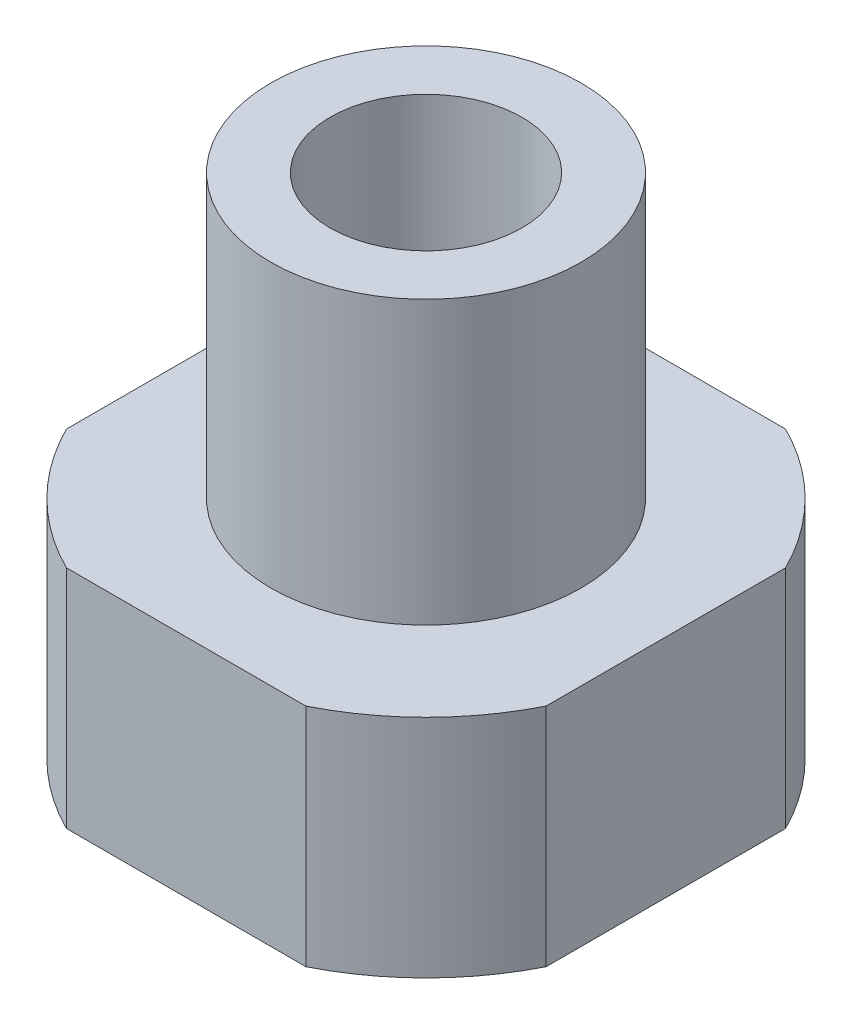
ISO-10303-21;
HEADER;
FILE_DESCRIPTION(('STEP AP214'),'2;1');
FILE_NAME('part.step','',(''),(''),'','','');
FILE_SCHEMA(('AUTOMOTIVE_DESIGN { 1 0 10303 214 1 1 1 1 }'));
ENDSEC;
DATA;
#1=APPLICATION_CONTEXT('core data for automotive mechanical design processes');
#2=APPLICATION_PROTOCOL_DEFINITION('international standard','automotive_design',2000,#1);
#3=PRODUCT_CONTEXT('',#1,'mechanical');
#4=PRODUCT('Part','Part','',(#3));
#5=PRODUCT_RELATED_PRODUCT_CATEGORY('part','',(#4));
#6=PRODUCT_DEFINITION_FORMATION('','',#4);
#7=PRODUCT_DEFINITION_CONTEXT('part definition',#1,'design');
#8=PRODUCT_DEFINITION('design','',#6,#7);
#9=PRODUCT_DEFINITION_SHAPE('','',#8);
#10=(LENGTH_UNIT() NAMED_UNIT(*) SI_UNIT(.MILLI.,.METRE.));
#11=(NAMED_UNIT(*) PLANE_ANGLE_UNIT() SI_UNIT($,.RADIAN.));
#12=(NAMED_UNIT(*) SI_UNIT($,.STERADIAN.) SOLID_ANGLE_UNIT());
#13=UNCERTAINTY_MEASURE_WITH_UNIT(LENGTH_MEASURE(1.E-05),#10,'distance_accuracy_value','');
#14=(GEOMETRIC_REPRESENTATION_CONTEXT(3) GLOBAL_UNCERTAINTY_ASSIGNED_CONTEXT((#13)) GLOBAL_UNIT_ASSIGNED_CONTEXT((#10,
#11,#12)) REPRESENTATION_CONTEXT('',''));
#15=CARTESIAN_POINT('',(0.,0.,0.));
#16=DIRECTION('',(0.,0.,1.));
#17=DIRECTION('',(1.,0.,0.));
#18=AXIS2_PLACEMENT_3D('',#15,#16,#17);
#19=CARTESIAN_POINT('',(25.5,43.,0.));
#20=DIRECTION('',(0.,1.,0.));
#21=DIRECTION('',(0.,0.,1.));
#22=AXIS2_PLACEMENT_3D('',#19,#20,#21);
#23=PLANE('',#22);
#24=CARTESIAN_POINT('',(25.5,43.,0.));
#25=DIRECTION('',(0.,1.,0.));
#26=DIRECTION('',(0.,0.,1.));
#27=AXIS2_PLACEMENT_3D('',#24,#25,#26);
#28=CIRCLE('',#27,3.4);
#29=CARTESIAN_POINT('',(25.5,43.,3.4));
#30=VERTEX_POINT('',#29);
#31=EDGE_CURVE('E182',#30,#30,#28,.T.);
#32=ORIENTED_EDGE('',*,*,#31,.T.);
#33=EDGE_LOOP('',(#32));
#34=FACE_BOUND('',#33,.T.);
#35=DIRECTION('',(0.,0.,1.));
#36=VECTOR('',#35,1.);
#37=CARTESIAN_POINT('',(17.,43.,0.));
#38=LINE('',#37,#36);
#39=CARTESIAN_POINT('',(17.,43.,-4.2426406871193));
#40=VERTEX_POINT('',#39);
#41=CARTESIAN_POINT('',(17.,43.,4.24264068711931));
#42=VERTEX_POINT('',#41);
#43=EDGE_CURVE('E147',#40,#42,#38,.T.);
#44=ORIENTED_EDGE('',*,*,#43,.F.);
#45=CARTESIAN_POINT('',(25.5,43.,0.));
#46=DIRECTION('',(0.,-1.,0.));
#47=DIRECTION('',(0.,0.,-1.));
#48=AXIS2_PLACEMENT_3D('',#45,#46,#47);
#49=CIRCLE('',#48,9.5);
#50=CARTESIAN_POINT('',(21.2573593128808,43.,-8.5));
#51=VERTEX_POINT('',#50);
#52=EDGE_CURVE('E113',#40,#51,#49,.T.);
#53=ORIENTED_EDGE('',*,*,#52,.T.);
#54=DIRECTION('',(-1.,0.,0.));
#55=VECTOR('',#54,1.);
#56=CARTESIAN_POINT('',(25.5,43.,-8.5));
#57=LINE('',#56,#55);
#58=CARTESIAN_POINT('',(29.7426406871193,43.,-8.5));
#59=VERTEX_POINT('',#58);
#60=EDGE_CURVE('E127',#59,#51,#57,.T.);
#61=ORIENTED_EDGE('',*,*,#60,.F.);
#62=CARTESIAN_POINT('',(34.,43.,-4.24264068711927));
#63=VERTEX_POINT('',#62);
#64=EDGE_CURVE('E90',#59,#63,#49,.T.);
#65=ORIENTED_EDGE('',*,*,#64,.T.);
#66=DIRECTION('',(0.,0.,-1.));
#67=VECTOR('',#66,1.);
#68=CARTESIAN_POINT('',(34.,43.,0.));
#69=LINE('',#68,#67);
#70=CARTESIAN_POINT('',(34.,43.,4.24264068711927));
#71=VERTEX_POINT('',#70);
#72=EDGE_CURVE('E139',#71,#63,#69,.T.);
#73=ORIENTED_EDGE('',*,*,#72,.F.);
#74=CARTESIAN_POINT('',(29.7426406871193,43.,8.5));
#75=VERTEX_POINT('',#74);
#76=EDGE_CURVE('E116',#71,#75,#49,.T.);
#77=ORIENTED_EDGE('',*,*,#76,.T.);
#78=DIRECTION('',(1.,0.,0.));
#79=VECTOR('',#78,1.);
#80=CARTESIAN_POINT('',(25.5,43.,8.5));
#81=LINE('',#80,#79);
#82=CARTESIAN_POINT('',(21.2573593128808,43.,8.5));
#83=VERTEX_POINT('',#82);
#84=EDGE_CURVE('E100',#83,#75,#81,.T.);
#85=ORIENTED_EDGE('',*,*,#84,.F.);
#86=EDGE_CURVE('E98',#83,#42,#49,.T.);
#87=ORIENTED_EDGE('',*,*,#86,.T.);
#88=EDGE_LOOP('',(#44,#53,#61,#65,#73,#77,#85,#87));
#89=FACE_BOUND('',#88,.T.);
#90=ADVANCED_FACE('F16',(#34,#89),#23,.F.);
#91=CARTESIAN_POINT('',(25.5,43.,0.));
#92=DIRECTION('',(0.,-1.,0.));
#93=DIRECTION('',(0.,0.,-1.));
#94=AXIS2_PLACEMENT_3D('',#91,#92,#93);
#95=CYLINDRICAL_SURFACE('',#94,9.5);
#96=DIRECTION('',(0.,-1.,0.));
#97=VECTOR('',#96,1.);
#98=CARTESIAN_POINT('',(17.,43.,-4.2426406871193));
#99=LINE('',#98,#97);
#100=CARTESIAN_POINT('',(17.,51.,-4.2426406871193));
#101=VERTEX_POINT('',#100);
#102=EDGE_CURVE('E149',#101,#40,#99,.T.);
#103=ORIENTED_EDGE('',*,*,#102,.F.);
#104=CARTESIAN_POINT('',(25.5,51.,0.));
#105=DIRECTION('',(0.,-1.,0.));
#106=DIRECTION('',(0.,0.,-1.));
#107=AXIS2_PLACEMENT_3D('',#104,#105,#106);
#108=CIRCLE('',#107,9.5);
#109=CARTESIAN_POINT('',(21.2573593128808,51.,-8.5));
#110=VERTEX_POINT('',#109);
#111=EDGE_CURVE('E105',#101,#110,#108,.T.);
#112=ORIENTED_EDGE('',*,*,#111,.T.);
#113=DIRECTION('',(0.,-1.,0.));
#114=VECTOR('',#113,1.);
#115=CARTESIAN_POINT('',(21.2573593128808,43.,-8.5));
#116=LINE('',#115,#114);
#117=EDGE_CURVE('E30',#51,#110,#116,.F.);
#118=ORIENTED_EDGE('',*,*,#117,.F.);
#119=ORIENTED_EDGE('',*,*,#52,.F.);
#120=EDGE_LOOP('',(#103,#112,#118,#119));
#121=FACE_BOUND('',#120,.T.);
#122=ADVANCED_FACE('F172',(#121),#95,.T.);
#123=DIRECTION('',(0.,-1.,0.));
#124=VECTOR('',#123,1.);
#125=CARTESIAN_POINT('',(17.,43.,4.24264068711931));
#126=LINE('',#125,#124);
#127=CARTESIAN_POINT('',(17.,51.,4.24264068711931));
#128=VERTEX_POINT('',#127);
#129=EDGE_CURVE('E37',#42,#128,#126,.F.);
#130=ORIENTED_EDGE('',*,*,#129,.F.);
#131=ORIENTED_EDGE('',*,*,#86,.F.);
#132=DIRECTION('',(0.,-1.,0.));
#133=VECTOR('',#132,1.);
#134=CARTESIAN_POINT('',(21.2573593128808,43.,8.5));
#135=LINE('',#134,#133);
#136=CARTESIAN_POINT('',(21.2573593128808,51.,8.5));
#137=VERTEX_POINT('',#136);
#138=EDGE_CURVE('E81',#137,#83,#135,.T.);
#139=ORIENTED_EDGE('',*,*,#138,.F.);
#140=EDGE_CURVE('E96',#137,#128,#108,.T.);
#141=ORIENTED_EDGE('',*,*,#140,.T.);
#142=EDGE_LOOP('',(#130,#131,#139,#141));
#143=FACE_BOUND('',#142,.T.);
#144=ADVANCED_FACE('F95',(#143),#95,.T.);
#145=DIRECTION('',(0.,-1.,0.));
#146=VECTOR('',#145,1.);
#147=CARTESIAN_POINT('',(29.7426406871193,43.,-8.5));
#148=LINE('',#147,#146);
#149=CARTESIAN_POINT('',(29.7426406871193,51.,-8.5));
#150=VERTEX_POINT('',#149);
#151=EDGE_CURVE('E120',#150,#59,#148,.T.);
#152=ORIENTED_EDGE('',*,*,#151,.F.);
#153=CARTESIAN_POINT('',(34.,51.,-4.24264068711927));
#154=VERTEX_POINT('',#153);
#155=EDGE_CURVE('E107',#150,#154,#108,.T.);
#156=ORIENTED_EDGE('',*,*,#155,.T.);
#157=DIRECTION('',(0.,-1.,0.));
#158=VECTOR('',#157,1.);
#159=CARTESIAN_POINT('',(34.,43.,-4.24264068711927));
#160=LINE('',#159,#158);
#161=EDGE_CURVE('E99',#63,#154,#160,.F.);
#162=ORIENTED_EDGE('',*,*,#161,.F.);
#163=ORIENTED_EDGE('',*,*,#64,.F.);
#164=EDGE_LOOP('',(#152,#156,#162,#163));
#165=FACE_BOUND('',#164,.T.);
#166=ADVANCED_FACE('F125',(#165),#95,.T.);
#167=DIRECTION('',(0.,-1.,0.));
#168=VECTOR('',#167,1.);
#169=CARTESIAN_POINT('',(34.,43.,4.24264068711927));
#170=LINE('',#169,#168);
#171=CARTESIAN_POINT('',(34.,51.,4.24264068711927));
#172=VERTEX_POINT('',#171);
#173=EDGE_CURVE('E133',#172,#71,#170,.T.);
#174=ORIENTED_EDGE('',*,*,#173,.F.);
#175=CARTESIAN_POINT('',(29.7426406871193,51.,8.5));
#176=VERTEX_POINT('',#175);
#177=EDGE_CURVE('E104',#172,#176,#108,.T.);
#178=ORIENTED_EDGE('',*,*,#177,.T.);
#179=DIRECTION('',(0.,-1.,0.));
#180=VECTOR('',#179,1.);
#181=CARTESIAN_POINT('',(29.7426406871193,43.,8.5));
#182=LINE('',#181,#180);
#183=EDGE_CURVE('E84',#75,#176,#182,.F.);
#184=ORIENTED_EDGE('',*,*,#183,.F.);
#185=ORIENTED_EDGE('',*,*,#76,.F.);
#186=EDGE_LOOP('',(#174,#178,#184,#185));
#187=FACE_BOUND('',#186,.T.);
#188=ADVANCED_FACE('F137',(#187),#95,.T.);
#189=CARTESIAN_POINT('',(16.,51.,0.));
#190=DIRECTION('',(0.,-1.,0.));
#191=DIRECTION('',(0.,0.,-1.));
#192=AXIS2_PLACEMENT_3D('',#189,#190,#191);
#193=PLANE('',#192);
#194=CARTESIAN_POINT('',(25.5,51.,0.));
#195=DIRECTION('',(0.,-1.,0.));
#196=DIRECTION('',(0.,0.,-1.));
#197=AXIS2_PLACEMENT_3D('',#194,#195,#196);
#198=CIRCLE('',#197,5.5);
#199=CARTESIAN_POINT('',(25.5,51.,-5.5));
#200=VERTEX_POINT('',#199);
#201=EDGE_CURVE('E109',#200,#200,#198,.T.);
#202=ORIENTED_EDGE('',*,*,#201,.T.);
#203=EDGE_LOOP('',(#202));
#204=FACE_BOUND('',#203,.T.);
#205=DIRECTION('',(0.,0.,-1.));
#206=VECTOR('',#205,1.);
#207=CARTESIAN_POINT('',(17.,51.,0.));
#208=LINE('',#207,#206);
#209=EDGE_CURVE('E11',#128,#101,#208,.T.);
#210=ORIENTED_EDGE('',*,*,#209,.F.);
#211=ORIENTED_EDGE('',*,*,#140,.F.);
#212=DIRECTION('',(-1.,0.,0.));
#213=VECTOR('',#212,1.);
#214=CARTESIAN_POINT('',(16.,51.,8.5));
#215=LINE('',#214,#213);
#216=EDGE_CURVE('E78',#176,#137,#215,.T.);
#217=ORIENTED_EDGE('',*,*,#216,.F.);
#218=ORIENTED_EDGE('',*,*,#177,.F.);
#219=DIRECTION('',(0.,0.,1.));
#220=VECTOR('',#219,1.);
#221=CARTESIAN_POINT('',(34.,51.,0.));
#222=LINE('',#221,#220);
#223=EDGE_CURVE('E89',#154,#172,#222,.T.);
#224=ORIENTED_EDGE('',*,*,#223,.F.);
#225=ORIENTED_EDGE('',*,*,#155,.F.);
#226=DIRECTION('',(1.,0.,0.));
#227=VECTOR('',#226,1.);
#228=CARTESIAN_POINT('',(16.,51.,-8.5));
#229=LINE('',#228,#227);
#230=EDGE_CURVE('E23',#110,#150,#229,.T.);
#231=ORIENTED_EDGE('',*,*,#230,.F.);
#232=ORIENTED_EDGE('',*,*,#111,.F.);
#233=EDGE_LOOP('',(#210,#211,#217,#218,#224,#225,#231,#232));
#234=FACE_BOUND('',#233,.T.);
#235=ADVANCED_FACE('F102',(#204,#234),#193,.F.);
#236=CARTESIAN_POINT('',(25.5,43.,0.));
#237=DIRECTION('',(0.,-1.,0.));
#238=DIRECTION('',(0.,0.,-1.));
#239=AXIS2_PLACEMENT_3D('',#236,#237,#238);
#240=CYLINDRICAL_SURFACE('',#239,5.5);
#241=ORIENTED_EDGE('',*,*,#201,.F.);
#242=EDGE_LOOP('',(#241));
#243=FACE_BOUND('',#242,.T.);
#244=CARTESIAN_POINT('',(25.5,61.,0.));
#245=DIRECTION('',(0.,-1.,0.));
#246=DIRECTION('',(0.,0.,-1.));
#247=AXIS2_PLACEMENT_3D('',#244,#245,#246);
#248=CIRCLE('',#247,5.5);
#249=CARTESIAN_POINT('',(25.5,61.,-5.5));
#250=VERTEX_POINT('',#249);
#251=EDGE_CURVE('E150',#250,#250,#248,.T.);
#252=ORIENTED_EDGE('',*,*,#251,.T.);
#253=EDGE_LOOP('',(#252));
#254=FACE_BOUND('',#253,.T.);
#255=ADVANCED_FACE('F158',(#243,#254),#240,.T.);
#256=CARTESIAN_POINT('',(20.,61.,0.));
#257=DIRECTION('',(0.,-1.,0.));
#258=DIRECTION('',(0.,0.,-1.));
#259=AXIS2_PLACEMENT_3D('',#256,#257,#258);
#260=PLANE('',#259);
#261=CARTESIAN_POINT('',(25.5,61.,0.));
#262=DIRECTION('',(0.,1.,0.));
#263=DIRECTION('',(0.,0.,1.));
#264=AXIS2_PLACEMENT_3D('',#261,#262,#263);
#265=CIRCLE('',#264,3.4);
#266=CARTESIAN_POINT('',(25.5,61.,3.4));
#267=VERTEX_POINT('',#266);
#268=EDGE_CURVE('E191',#267,#267,#265,.T.);
#269=ORIENTED_EDGE('',*,*,#268,.F.);
#270=EDGE_LOOP('',(#269));
#271=FACE_BOUND('',#270,.T.);
#272=ORIENTED_EDGE('',*,*,#251,.F.);
#273=EDGE_LOOP('',(#272));
#274=FACE_BOUND('',#273,.T.);
#275=ADVANCED_FACE('F160',(#271,#274),#260,.F.);
#276=CARTESIAN_POINT('',(34.,31.,8.5));
#277=DIRECTION('',(0.,0.,1.));
#278=DIRECTION('',(1.,0.,0.));
#279=AXIS2_PLACEMENT_3D('',#276,#277,#278);
#280=PLANE('',#279);
#281=ORIENTED_EDGE('',*,*,#138,.T.);
#282=ORIENTED_EDGE('',*,*,#84,.T.);
#283=ORIENTED_EDGE('',*,*,#183,.T.);
#284=ORIENTED_EDGE('',*,*,#216,.T.);
#285=EDGE_LOOP('',(#281,#282,#283,#284));
#286=FACE_BOUND('',#285,.T.);
#287=ADVANCED_FACE('F80',(#286),#280,.T.);
#288=CARTESIAN_POINT('',(34.,31.,-8.5));
#289=DIRECTION('',(1.,0.,0.));
#290=DIRECTION('',(0.,0.,-1.));
#291=AXIS2_PLACEMENT_3D('',#288,#289,#290);
#292=PLANE('',#291);
#293=ORIENTED_EDGE('',*,*,#173,.T.);
#294=ORIENTED_EDGE('',*,*,#72,.T.);
#295=ORIENTED_EDGE('',*,*,#161,.T.);
#296=ORIENTED_EDGE('',*,*,#223,.T.);
#297=EDGE_LOOP('',(#293,#294,#295,#296));
#298=FACE_BOUND('',#297,.T.);
#299=ADVANCED_FACE('F132',(#298),#292,.T.);
#300=CARTESIAN_POINT('',(34.,31.,-8.5));
#301=DIRECTION('',(0.,0.,-1.));
#302=DIRECTION('',(-1.,0.,0.));
#303=AXIS2_PLACEMENT_3D('',#300,#301,#302);
#304=PLANE('',#303);
#305=ORIENTED_EDGE('',*,*,#151,.T.);
#306=ORIENTED_EDGE('',*,*,#60,.T.);
#307=ORIENTED_EDGE('',*,*,#117,.T.);
#308=ORIENTED_EDGE('',*,*,#230,.T.);
#309=EDGE_LOOP('',(#305,#306,#307,#308));
#310=FACE_BOUND('',#309,.T.);
#311=ADVANCED_FACE('F119',(#310),#304,.T.);
#312=CARTESIAN_POINT('',(17.,31.,-8.5));
#313=DIRECTION('',(-1.,0.,0.));
#314=DIRECTION('',(0.,0.,1.));
#315=AXIS2_PLACEMENT_3D('',#312,#313,#314);
#316=PLANE('',#315);
#317=ORIENTED_EDGE('',*,*,#102,.T.);
#318=ORIENTED_EDGE('',*,*,#43,.T.);
#319=ORIENTED_EDGE('',*,*,#129,.T.);
#320=ORIENTED_EDGE('',*,*,#209,.T.);
#321=EDGE_LOOP('',(#317,#318,#319,#320));
#322=FACE_BOUND('',#321,.T.);
#323=ADVANCED_FACE('F198',(#322),#316,.T.);
#324=CARTESIAN_POINT('',(25.5,61.,0.));
#325=DIRECTION('',(0.,1.,0.));
#326=DIRECTION('',(0.,0.,1.));
#327=AXIS2_PLACEMENT_3D('',#324,#325,#326);
#328=CYLINDRICAL_SURFACE('',#327,3.4);
#329=ORIENTED_EDGE('',*,*,#31,.F.);
#330=EDGE_LOOP('',(#329));
#331=FACE_BOUND('',#330,.T.);
#332=ORIENTED_EDGE('',*,*,#268,.T.);
#333=EDGE_LOOP('',(#332));
#334=FACE_BOUND('',#333,.T.);
#335=ADVANCED_FACE('F195',(#331,#334),#328,.F.);
#336=CLOSED_SHELL('',(#90,#122,#144,#166,#188,#235,#255,#275,#287,#299,#311,#323,#335));
#337=MANIFOLD_SOLID_BREP('B1',#336);
#338=ADVANCED_BREP_SHAPE_REPRESENTATION('',(#18,#337),#14);
#339=SHAPE_DEFINITION_REPRESENTATION(#9,#338);
ENDSEC;
END-ISO-10303-21;
